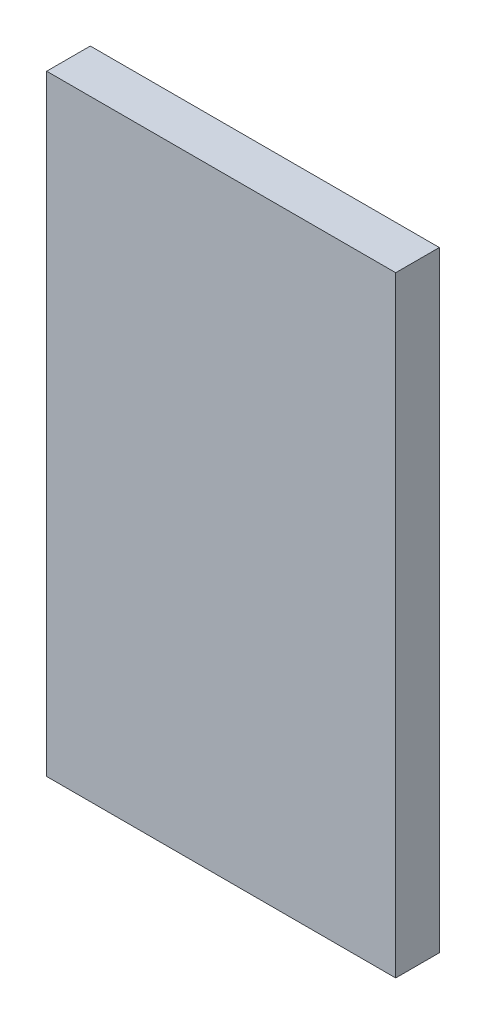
from build123d import *

# Parameters (mm, degrees)
ESQUISSE1_W      = 40
ESQUISSE1_H      = 70
EXTRUSION1_DEPTH = 5


with BuildPart() as part:
    # Esquisse1 → Extrusion1 (new body)
    with BuildSketch(Plane.XY):
        with Locations((20, 35)):
            Rectangle(ESQUISSE1_W, ESQUISSE1_H)
    extrude(amount=EXTRUSION1_DEPTH)


solid = part.part
